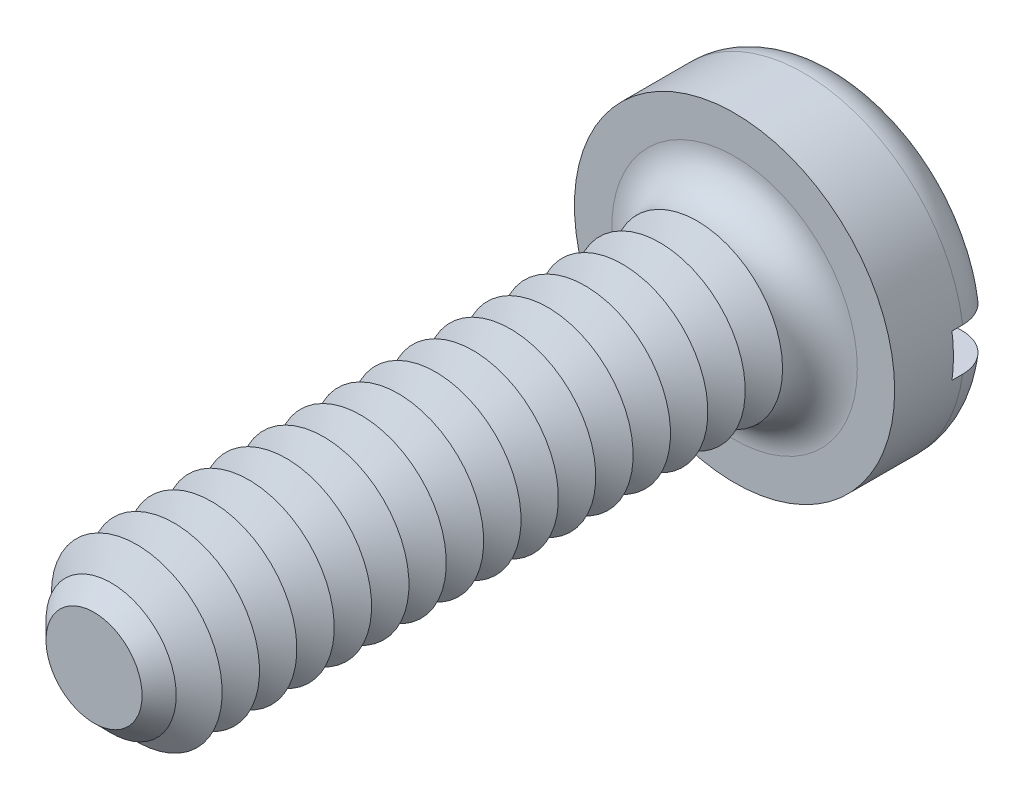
ISO-10303-21;
HEADER;
FILE_DESCRIPTION(('STEP AP214'),'2;1');
FILE_NAME('part.step','',(''),(''),'','','');
FILE_SCHEMA(('AUTOMOTIVE_DESIGN { 1 0 10303 214 1 1 1 1 }'));
ENDSEC;
DATA;
#1=APPLICATION_CONTEXT('core data for automotive mechanical design processes');
#2=APPLICATION_PROTOCOL_DEFINITION('international standard','automotive_design',2000,#1);
#3=PRODUCT_CONTEXT('',#1,'mechanical');
#4=PRODUCT('Part','Part','',(#3));
#5=PRODUCT_RELATED_PRODUCT_CATEGORY('part','',(#4));
#6=PRODUCT_DEFINITION_FORMATION('','',#4);
#7=PRODUCT_DEFINITION_CONTEXT('part definition',#1,'design');
#8=PRODUCT_DEFINITION('design','',#6,#7);
#9=PRODUCT_DEFINITION_SHAPE('','',#8);
#10=(LENGTH_UNIT() NAMED_UNIT(*) SI_UNIT(.MILLI.,.METRE.));
#11=(NAMED_UNIT(*) PLANE_ANGLE_UNIT() SI_UNIT($,.RADIAN.));
#12=(NAMED_UNIT(*) SI_UNIT($,.STERADIAN.) SOLID_ANGLE_UNIT());
#13=UNCERTAINTY_MEASURE_WITH_UNIT(LENGTH_MEASURE(1.E-05),#10,'distance_accuracy_value','');
#14=(GEOMETRIC_REPRESENTATION_CONTEXT(3) GLOBAL_UNCERTAINTY_ASSIGNED_CONTEXT((#13)) GLOBAL_UNIT_ASSIGNED_CONTEXT((#10,
#11,#12)) REPRESENTATION_CONTEXT('',''));
#15=CARTESIAN_POINT('',(0.,0.,0.));
#16=DIRECTION('',(0.,0.,1.));
#17=DIRECTION('',(1.,0.,0.));
#18=AXIS2_PLACEMENT_3D('',#15,#16,#17);
#19=CARTESIAN_POINT('',(0.,0.,-1.));
#20=DIRECTION('',(0.,0.,1.));
#21=DIRECTION('',(1.,0.,0.));
#22=AXIS2_PLACEMENT_3D('',#19,#20,#21);
#23=PLANE('',#22);
#24=CARTESIAN_POINT('',(0.,0.,-1.));
#25=DIRECTION('',(0.,0.,1.));
#26=DIRECTION('',(1.,0.,0.));
#27=AXIS2_PLACEMENT_3D('',#24,#25,#26);
#28=CIRCLE('',#27,1.15);
#29=CARTESIAN_POINT('',(-1.13247516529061,0.2,-1.));
#30=VERTEX_POINT('',#29);
#31=CARTESIAN_POINT('',(1.13247516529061,0.2,-1.));
#32=VERTEX_POINT('',#31);
#33=EDGE_CURVE('E105',#30,#32,#28,.F.);
#34=ORIENTED_EDGE('',*,*,#33,.T.);
#35=DIRECTION('',(1.,0.,0.));
#36=VECTOR('',#35,1.);
#37=CARTESIAN_POINT('',(-1.5,0.2,-1.));
#38=LINE('',#37,#36);
#39=EDGE_CURVE('E101',#30,#32,#38,.T.);
#40=ORIENTED_EDGE('',*,*,#39,.F.);
#41=EDGE_LOOP('',(#34,#40));
#42=FACE_BOUND('',#41,.T.);
#43=ADVANCED_FACE('F32',(#42),#23,.F.);
#44=CARTESIAN_POINT('',(0.,0.,-0.65));
#45=DIRECTION('',(0.,0.,1.));
#46=DIRECTION('',(1.,0.,0.));
#47=AXIS2_PLACEMENT_3D('',#44,#45,#46);
#48=TOROIDAL_SURFACE('',#47,1.15,0.35);
#49=CARTESIAN_POINT('',(-1.38697162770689,0.2,-0.89359719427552));
#50=CARTESIAN_POINT('',(-1.37305556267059,0.2,-0.907805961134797));
#51=CARTESIAN_POINT('',(-1.35791811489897,0.2,-0.9208403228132));
#52=CARTESIAN_POINT('',(-1.32565069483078,0.2,-0.944183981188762));
#53=CARTESIAN_POINT('',(-1.3085180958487,0.2,-0.954489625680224));
#54=CARTESIAN_POINT('',(-1.27278567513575,0.2,-0.972077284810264));
#55=CARTESIAN_POINT('',(-1.25418732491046,0.2,-0.979362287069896));
#56=CARTESIAN_POINT('',(-1.21604452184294,0.2,-0.990735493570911));
#57=CARTESIAN_POINT('',(-1.19650030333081,0.2,-0.994824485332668));
#58=CARTESIAN_POINT('',(-1.15682398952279,0.2,-0.99973845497));
#59=CARTESIAN_POINT('',(-1.1366881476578,0.2,-1.00053316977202));
#60=CARTESIAN_POINT('',(-1.09656272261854,0.2,-0.998770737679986));
#61=CARTESIAN_POINT('',(-1.07657315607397,0.2,-0.996213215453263));
#62=CARTESIAN_POINT('',(-1.03707277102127,0.2,-0.987780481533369));
#63=CARTESIAN_POINT('',(-1.01756977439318,0.2,-0.981868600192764));
#64=CARTESIAN_POINT('',(-0.979825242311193,0.2,-0.966867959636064));
#65=CARTESIAN_POINT('',(-0.961583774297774,0.2,-0.957779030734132));
#66=CARTESIAN_POINT('',(-0.926815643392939,0.2,-0.936628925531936));
#67=CARTESIAN_POINT('',(-0.910295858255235,0.2,-0.924556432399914));
#68=CARTESIAN_POINT('',(-0.879544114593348,0.2,-0.897781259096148));
#69=CARTESIAN_POINT('',(-0.8653120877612,0.2,-0.883078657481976));
#70=CARTESIAN_POINT('',(-0.83972745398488,0.2,-0.851619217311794));
#71=CARTESIAN_POINT('',(-0.8283448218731,0.2,-0.834886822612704));
#72=CARTESIAN_POINT('',(-0.80863848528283,0.2,-0.799707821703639));
#73=CARTESIAN_POINT('',(-0.80031425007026,0.2,-0.781261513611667));
#74=CARTESIAN_POINT('',(-0.787199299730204,0.2,-0.743695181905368));
#75=CARTESIAN_POINT('',(-0.782321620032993,0.2,-0.724605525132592));
#76=CARTESIAN_POINT('',(-0.775930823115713,0.2,-0.685871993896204));
#77=CARTESIAN_POINT('',(-0.774417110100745,0.2,-0.666228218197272));
#78=CARTESIAN_POINT('',(-0.774805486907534,0.2,-0.627456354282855));
#79=CARTESIAN_POINT('',(-0.776625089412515,0.2,-0.608327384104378));
#80=CARTESIAN_POINT('',(-0.783452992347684,0.2,-0.570648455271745));
#81=CARTESIAN_POINT('',(-0.788461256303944,0.2,-0.552098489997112));
#82=CARTESIAN_POINT('',(-0.801489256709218,0.2,-0.516098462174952));
#83=CARTESIAN_POINT('',(-0.809507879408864,0.2,-0.49864799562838));
#84=CARTESIAN_POINT('',(-0.828295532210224,0.2,-0.465297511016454));
#85=CARTESIAN_POINT('',(-0.839064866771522,0.2,-0.449397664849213));
#86=CARTESIAN_POINT('',(-0.863311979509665,0.2,-0.419196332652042));
#87=CARTESIAN_POINT('',(-0.876847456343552,0.2,-0.404941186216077));
#88=CARTESIAN_POINT('',(-0.906064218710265,0.2,-0.378832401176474));
#89=CARTESIAN_POINT('',(-0.921745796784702,0.2,-0.366979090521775));
#90=CARTESIAN_POINT('',(-0.955261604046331,0.2,-0.345690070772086));
#91=CARTESIAN_POINT('',(-0.973141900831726,0.2,-0.336326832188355));
#92=CARTESIAN_POINT('',(-1.01020647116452,0.2,-0.320690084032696));
#93=CARTESIAN_POINT('',(-1.02939085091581,0.2,-0.314416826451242));
#94=CARTESIAN_POINT('',(-1.06878849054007,0.2,-0.305073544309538));
#95=CARTESIAN_POINT('',(-1.0890118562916,0.2,-0.302046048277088));
#96=CARTESIAN_POINT('',(-1.12968032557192,0.2,-0.299436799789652));
#97=CARTESIAN_POINT('',(-1.15012542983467,0.2,-0.299855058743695));
#98=CARTESIAN_POINT('',(-1.1906059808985,0.2,-0.304138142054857));
#99=CARTESIAN_POINT('',(-1.21064224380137,0.2,-0.307995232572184));
#100=CARTESIAN_POINT('',(-1.24976957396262,0.2,-0.319055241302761));
#101=CARTESIAN_POINT('',(-1.26886068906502,0.2,-0.326257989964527));
#102=CARTESIAN_POINT('',(-1.30533597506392,0.2,-0.343725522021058));
#103=CARTESIAN_POINT('',(-1.32273620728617,0.2,-0.353956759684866));
#104=CARTESIAN_POINT('',(-1.35554323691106,0.2,-0.377229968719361));
#105=CARTESIAN_POINT('',(-1.37095016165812,0.2,-0.390271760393));
#106=CARTESIAN_POINT('',(-1.39913145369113,0.2,-0.418621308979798));
#107=CARTESIAN_POINT('',(-1.41193602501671,0.2,-0.43389904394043));
#108=CARTESIAN_POINT('',(-1.43476712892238,0.2,-0.46640589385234));
#109=CARTESIAN_POINT('',(-1.44479381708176,0.2,-0.483634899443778));
#110=CARTESIAN_POINT('',(-1.4616814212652,0.2,-0.519367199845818));
#111=CARTESIAN_POINT('',(-1.46857323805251,0.2,-0.537855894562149));
#112=CARTESIAN_POINT('',(-1.4791331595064,0.2,-0.575731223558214));
#113=CARTESIAN_POINT('',(-1.48280152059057,0.2,-0.595117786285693));
#114=CARTESIAN_POINT('',(-1.4867930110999,0.2,-0.634109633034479));
#115=CARTESIAN_POINT('',(-1.48713684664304,0.2,-0.653712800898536));
#116=CARTESIAN_POINT('',(-1.48452244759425,0.2,-0.692702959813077));
#117=CARTESIAN_POINT('',(-1.48156342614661,0.2,-0.712089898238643));
#118=CARTESIAN_POINT('',(-1.47243636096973,0.2,-0.75006822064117));
#119=CARTESIAN_POINT('',(-1.46627182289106,0.2,-0.768660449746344));
#120=CARTESIAN_POINT('',(-1.45092056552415,0.2,-0.804533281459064));
#121=CARTESIAN_POINT('',(-1.44173755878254,0.2,-0.821815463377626));
#122=CARTESIAN_POINT('',(-1.42477940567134,0.2,-0.848152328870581));
#123=CARTESIAN_POINT('',(-1.41786672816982,0.2,-0.857773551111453));
#124=CARTESIAN_POINT('',(-1.40310412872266,0.2,-0.876267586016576));
#125=CARTESIAN_POINT('',(-1.39525421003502,0.2,-0.885140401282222));
#126=CARTESIAN_POINT('',(-1.38697162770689,0.2,-0.89359719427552));
#127=B_SPLINE_CURVE_WITH_KNOTS('',3,(#49,#50,#51,#52,#53,#54,#55,#56,#57,#58,#59,#60,#61,#62,
#63,#64,#65,#66,#67,#68,#69,#70,#71,#72,#73,#74,#75,#76,#77,#78,#79,#80,#81,#82,#83,#84,#85,#86,
#87,#88,#89,#90,#91,#92,#93,#94,#95,#96,#97,#98,#99,#100,#101,#102,#103,#104,#105,#106,#107,
#108,#109,#110,#111,#112,#113,#114,#115,#116,#117,#118,#119,#120,#121,#122,#123,#124,#125,#126),
.UNSPECIFIED.,.T.,.F.,(4,2,2,2,2,2,2,2,2,2,2,2,2,2,2,2,2,2,2,2,2,2,2,2,2,2,2,2,2,2,2,2,2,2,2,2,
2,2,4),(0.,0.0596211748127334,0.119321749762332,0.178963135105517,0.238589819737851,
0.298763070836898,0.358943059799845,0.419793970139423,0.48064813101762,0.541736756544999,
0.602823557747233,0.663236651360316,0.72363925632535,0.782457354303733,0.841265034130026,
0.898637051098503,0.956008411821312,1.01335856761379,1.07071507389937,1.12941939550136,
1.18813172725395,1.24840147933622,1.30867614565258,1.36973127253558,1.43078660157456,
1.49170496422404,1.55262023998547,1.61288453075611,1.67314496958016,1.73266007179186,
1.792171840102,1.85108355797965,1.90999058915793,1.96853049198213,2.02708434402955,
2.08557429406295,2.14399257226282,2.17947810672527,2.21496351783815),.UNSPECIFIED.);
#128=CARTESIAN_POINT('',(-1.48660687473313,0.2,-0.649999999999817));
#129=VERTEX_POINT('',#128);
#130=EDGE_CURVE('E296',#129,#30,#127,.T.);
#131=ORIENTED_EDGE('',*,*,#130,.F.);
#132=CARTESIAN_POINT('',(0.,0.,-0.65));
#133=DIRECTION('',(0.,0.,1.));
#134=DIRECTION('',(1.,0.,0.));
#135=AXIS2_PLACEMENT_3D('',#132,#133,#134);
#136=CIRCLE('',#135,1.5);
#137=CARTESIAN_POINT('',(1.48660687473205,0.2,-0.649999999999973));
#138=VERTEX_POINT('',#137);
#139=EDGE_CURVE('E110',#138,#129,#136,.T.);
#140=ORIENTED_EDGE('',*,*,#139,.F.);
#141=CARTESIAN_POINT('',(0.780520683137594,0.2,-0.713112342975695));
#142=CARTESIAN_POINT('',(0.784146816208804,0.2,-0.73226748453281));
#143=CARTESIAN_POINT('',(0.789425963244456,0.2,-0.751125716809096));
#144=CARTESIAN_POINT('',(0.803106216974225,0.2,-0.78769198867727));
#145=CARTESIAN_POINT('',(0.811511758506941,0.2,-0.805398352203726));
#146=CARTESIAN_POINT('',(0.831144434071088,0.2,-0.839131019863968));
#147=CARTESIAN_POINT('',(0.842366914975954,0.2,-0.855160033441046));
#148=CARTESIAN_POINT('',(0.867288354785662,0.2,-0.88515062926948));
#149=CARTESIAN_POINT('',(0.880986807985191,0.2,-0.899112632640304));
#150=CARTESIAN_POINT('',(0.910770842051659,0.2,-0.924888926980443));
#151=CARTESIAN_POINT('',(0.926899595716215,0.2,-0.936653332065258));
#152=CARTESIAN_POINT('',(0.960871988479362,0.2,-0.957372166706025));
#153=CARTESIAN_POINT('',(0.978715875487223,0.2,-0.966326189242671));
#154=CARTESIAN_POINT('',(1.01600338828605,0.2,-0.981340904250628));
#155=CARTESIAN_POINT('',(1.03547204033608,0.2,-0.987339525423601));
#156=CARTESIAN_POINT('',(1.07513874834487,0.2,-0.995998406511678));
#157=CARTESIAN_POINT('',(1.09533683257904,0.2,-0.998658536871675));
#158=CARTESIAN_POINT('',(1.1359751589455,0.2,-1.0005575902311));
#159=CARTESIAN_POINT('',(1.1564160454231,0.2,-0.99978283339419));
#160=CARTESIAN_POINT('',(1.19687229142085,0.2,-0.994784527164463));
#161=CARTESIAN_POINT('',(1.21688766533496,0.2,-0.990561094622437));
#162=CARTESIAN_POINT('',(1.25575385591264,0.2,-0.978813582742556));
#163=CARTESIAN_POINT('',(1.27461259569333,0.2,-0.971315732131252));
#164=CARTESIAN_POINT('',(1.31078063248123,0.2,-0.953221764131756));
#165=CARTESIAN_POINT('',(1.32809002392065,0.2,-0.942625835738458));
#166=CARTESIAN_POINT('',(1.36044102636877,0.2,-0.918776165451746));
#167=CARTESIAN_POINT('',(1.37550786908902,0.2,-0.905556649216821));
#168=CARTESIAN_POINT('',(1.40317627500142,0.2,-0.876749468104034));
#169=CARTESIAN_POINT('',(1.41577799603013,0.2,-0.861161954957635));
#170=CARTESIAN_POINT('',(1.43800830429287,0.2,-0.828254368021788));
#171=CARTESIAN_POINT('',(1.44766923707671,0.2,-0.810956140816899));
#172=CARTESIAN_POINT('',(1.46392269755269,0.2,-0.774973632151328));
#173=CARTESIAN_POINT('',(1.4705153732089,0.2,-0.756289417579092));
#174=CARTESIAN_POINT('',(1.48039453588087,0.2,-0.718226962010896));
#175=CARTESIAN_POINT('',(1.48370713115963,0.2,-0.69885549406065));
#176=CARTESIAN_POINT('',(1.48701993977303,0.2,-0.659831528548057));
#177=CARTESIAN_POINT('',(1.4870202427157,0.2,-0.640179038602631));
#178=CARTESIAN_POINT('',(1.48371470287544,0.2,-0.6012267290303));
#179=CARTESIAN_POINT('',(1.48042091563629,0.2,-0.581925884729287));
#180=CARTESIAN_POINT('',(1.47064268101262,0.2,-0.544150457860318));
#181=CARTESIAN_POINT('',(1.46415824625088,0.2,-0.525675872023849));
#182=CARTESIAN_POINT('',(1.4481813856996,0.2,-0.490055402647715));
#183=CARTESIAN_POINT('',(1.43868601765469,0.2,-0.472910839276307));
#184=CARTESIAN_POINT('',(1.41696658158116,0.2,-0.440447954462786));
#185=CARTESIAN_POINT('',(1.40474246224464,0.2,-0.425129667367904));
#186=CARTESIAN_POINT('',(1.37784446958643,0.2,-0.39666049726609));
#187=CARTESIAN_POINT('',(1.36315749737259,0.2,-0.383521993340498));
#188=CARTESIAN_POINT('',(1.33180407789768,0.2,-0.359869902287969));
#189=CARTESIAN_POINT('',(1.31513754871,0.2,-0.349356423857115));
#190=CARTESIAN_POINT('',(1.28013085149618,0.2,-0.331143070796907));
#191=CARTESIAN_POINT('',(1.26177629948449,0.2,-0.323470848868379));
#192=CARTESIAN_POINT('',(1.224049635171,0.2,-0.311275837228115));
#193=CARTESIAN_POINT('',(1.20467746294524,0.2,-0.306753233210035));
#194=CARTESIAN_POINT('',(1.1652160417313,0.2,-0.300927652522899));
#195=CARTESIAN_POINT('',(1.14512096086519,0.2,-0.299664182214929));
#196=CARTESIAN_POINT('',(1.10499953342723,0.2,-0.300488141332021));
#197=CARTESIAN_POINT('',(1.08497319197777,0.2,-0.302575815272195));
#198=CARTESIAN_POINT('',(1.04531606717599,0.2,-0.310075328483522));
#199=CARTESIAN_POINT('',(1.0256923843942,0.2,-0.315524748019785));
#200=CARTESIAN_POINT('',(0.987629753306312,0.2,-0.329624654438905));
#201=CARTESIAN_POINT('',(0.96919087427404,0.2,-0.338275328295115));
#202=CARTESIAN_POINT('',(0.933939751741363,0.2,-0.358590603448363));
#203=CARTESIAN_POINT('',(0.917135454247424,0.2,-0.370269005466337));
#204=CARTESIAN_POINT('',(0.88574931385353,0.2,-0.396306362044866));
#205=CARTESIAN_POINT('',(0.87116734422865,0.2,-0.410665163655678));
#206=CARTESIAN_POINT('',(0.844813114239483,0.2,-0.441518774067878));
#207=CARTESIAN_POINT('',(0.833014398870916,0.2,-0.457990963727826));
#208=CARTESIAN_POINT('',(0.812431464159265,0.2,-0.492729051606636));
#209=CARTESIAN_POINT('',(0.803647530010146,0.2,-0.510995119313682));
#210=CARTESIAN_POINT('',(0.789590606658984,0.2,-0.548308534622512));
#211=CARTESIAN_POINT('',(0.784235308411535,0.2,-0.5673249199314));
#212=CARTESIAN_POINT('',(0.7768953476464,0.2,-0.605979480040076));
#213=CARTESIAN_POINT('',(0.774905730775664,0.2,-0.625616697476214));
#214=CARTESIAN_POINT('',(0.774470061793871,0.2,-0.656633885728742));
#215=CARTESIAN_POINT('',(0.7748847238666,0.2,-0.668009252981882));
#216=CARTESIAN_POINT('',(0.776852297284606,0.2,-0.690660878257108));
#217=CARTESIAN_POINT('',(0.77840517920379,0.2,-0.701937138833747));
#218=CARTESIAN_POINT('',(0.780520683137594,0.2,-0.713112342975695));
#219=B_SPLINE_CURVE_WITH_KNOTS('',3,(#141,#142,#143,#144,#145,#146,#147,#148,#149,#150,#151,
#152,#153,#154,#155,#156,#157,#158,#159,#160,#161,#162,#163,#164,#165,#166,#167,#168,#169,#170,
#171,#172,#173,#174,#175,#176,#177,#178,#179,#180,#181,#182,#183,#184,#185,#186,#187,#188,#189,
#190,#191,#192,#193,#194,#195,#196,#197,#198,#199,#200,#201,#202,#203,#204,#205,#206,#207,#208,
#209,#210,#211,#212,#213,#214,#215,#216,#217,#218),.UNSPECIFIED.,.T.,.F.,(4,2,2,2,2,2,2,2,2,2,2,
2,2,2,2,2,2,2,2,2,2,2,2,2,2,2,2,2,2,2,2,2,2,2,2,2,2,2,4),(0.,0.0584431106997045,
0.11696944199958,0.175399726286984,0.233818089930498,0.293433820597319,0.353058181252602,
0.413886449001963,0.474717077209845,0.53579018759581,0.596861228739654,0.65745180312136,
0.718038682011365,0.777881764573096,0.837721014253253,0.896876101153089,0.95602833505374,
1.01470585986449,1.07338179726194,1.13184377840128,1.19030552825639,1.24882458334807,
1.30734473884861,1.36618662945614,1.42503095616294,1.48443380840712,1.54384016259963,
1.60396331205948,1.66409084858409,1.72490303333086,1.78571877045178,1.84681674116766,
1.90791122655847,1.96839922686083,2.02889294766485,2.08787382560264,2.14676780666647,
2.18086468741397,2.21496068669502),.UNSPECIFIED.);
#220=EDGE_CURVE('E298',#32,#138,#219,.T.);
#221=ORIENTED_EDGE('',*,*,#220,.F.);
#222=ORIENTED_EDGE('',*,*,#33,.F.);
#223=EDGE_LOOP('',(#131,#140,#221,#222));
#224=FACE_BOUND('',#223,.T.);
#225=ADVANCED_FACE('F280',(#224),#48,.T.);
#226=CARTESIAN_POINT('',(0.,0.,-1.));
#227=DIRECTION('',(0.,0.,1.));
#228=DIRECTION('',(1.,0.,0.));
#229=AXIS2_PLACEMENT_3D('',#226,#227,#228);
#230=CYLINDRICAL_SURFACE('',#229,1.5);
#231=DIRECTION('',(0.,0.,1.));
#232=VECTOR('',#231,1.);
#233=CARTESIAN_POINT('',(1.48660687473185,0.2,-1.));
#234=LINE('',#233,#232);
#235=CARTESIAN_POINT('',(1.48660687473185,0.2,-0.55));
#236=VERTEX_POINT('',#235);
#237=EDGE_CURVE('E306',#138,#236,#234,.T.);
#238=ORIENTED_EDGE('',*,*,#237,.F.);
#239=ORIENTED_EDGE('',*,*,#139,.T.);
#240=DIRECTION('',(0.,0.,1.));
#241=VECTOR('',#240,1.);
#242=CARTESIAN_POINT('',(-1.48660687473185,0.2,-1.));
#243=LINE('',#242,#241);
#244=CARTESIAN_POINT('',(-1.48660687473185,0.2,-0.55));
#245=VERTEX_POINT('',#244);
#246=EDGE_CURVE('E55',#245,#129,#243,.F.);
#247=ORIENTED_EDGE('',*,*,#246,.F.);
#248=CARTESIAN_POINT('',(0.,0.,-0.55));
#249=DIRECTION('',(0.,0.,-1.));
#250=DIRECTION('',(-1.,0.,0.));
#251=AXIS2_PLACEMENT_3D('',#248,#249,#250);
#252=CIRCLE('',#251,1.5);
#253=CARTESIAN_POINT('',(-1.48660687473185,-0.2,-0.55));
#254=VERTEX_POINT('',#253);
#255=EDGE_CURVE('E36',#245,#254,#252,.F.);
#256=ORIENTED_EDGE('',*,*,#255,.T.);
#257=DIRECTION('',(0.,0.,1.));
#258=VECTOR('',#257,1.);
#259=CARTESIAN_POINT('',(-1.48660687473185,-0.2,-1.));
#260=LINE('',#259,#258);
#261=CARTESIAN_POINT('',(-1.48660687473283,-0.2,-0.650000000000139));
#262=VERTEX_POINT('',#261);
#263=EDGE_CURVE('E304',#262,#254,#260,.T.);
#264=ORIENTED_EDGE('',*,*,#263,.F.);
#265=CARTESIAN_POINT('',(1.48660687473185,-0.2,-0.65));
#266=VERTEX_POINT('',#265);
#267=EDGE_CURVE('E112',#262,#266,#136,.T.);
#268=ORIENTED_EDGE('',*,*,#267,.T.);
#269=DIRECTION('',(0.,0.,1.));
#270=VECTOR('',#269,1.);
#271=CARTESIAN_POINT('',(1.48660687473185,-0.2,-1.));
#272=LINE('',#271,#270);
#273=CARTESIAN_POINT('',(1.48660687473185,-0.2,-0.55));
#274=VERTEX_POINT('',#273);
#275=EDGE_CURVE('E47',#274,#266,#272,.F.);
#276=ORIENTED_EDGE('',*,*,#275,.F.);
#277=EDGE_CURVE('E11',#274,#236,#252,.F.);
#278=ORIENTED_EDGE('',*,*,#277,.T.);
#279=EDGE_LOOP('',(#238,#239,#247,#256,#264,#268,#276,#278));
#280=FACE_BOUND('',#279,.T.);
#281=CARTESIAN_POINT('',(0.,0.,0.));
#282=DIRECTION('',(0.,0.,1.));
#283=DIRECTION('',(1.,0.,0.));
#284=AXIS2_PLACEMENT_3D('',#281,#282,#283);
#285=CIRCLE('',#284,1.5);
#286=CARTESIAN_POINT('',(1.5,0.,0.));
#287=VERTEX_POINT('',#286);
#288=EDGE_CURVE('E308',#287,#287,#285,.T.);
#289=ORIENTED_EDGE('',*,*,#288,.F.);
#290=EDGE_LOOP('',(#289));
#291=FACE_BOUND('',#290,.T.);
#292=ADVANCED_FACE('F276',(#280,#291),#230,.T.);
#293=CARTESIAN_POINT('',(1.13247516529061,-0.2,-1.));
#294=VERTEX_POINT('',#293);
#295=CARTESIAN_POINT('',(-1.13247516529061,-0.2,-1.));
#296=VERTEX_POINT('',#295);
#297=EDGE_CURVE('E100',#294,#296,#28,.F.);
#298=ORIENTED_EDGE('',*,*,#297,.T.);
#299=DIRECTION('',(-1.,0.,0.));
#300=VECTOR('',#299,1.);
#301=CARTESIAN_POINT('',(-1.5,-0.2,-1.));
#302=LINE('',#301,#300);
#303=EDGE_CURVE('E88',#294,#296,#302,.T.);
#304=ORIENTED_EDGE('',*,*,#303,.F.);
#305=EDGE_LOOP('',(#298,#304));
#306=FACE_BOUND('',#305,.T.);
#307=ADVANCED_FACE('F99',(#306),#23,.F.);
#308=CARTESIAN_POINT('',(0.,0.,0.));
#309=DIRECTION('',(0.,0.,1.));
#310=DIRECTION('',(1.,0.,0.));
#311=AXIS2_PLACEMENT_3D('',#308,#309,#310);
#312=PLANE('',#311);
#313=CARTESIAN_POINT('',(0.,0.,0.));
#314=DIRECTION('',(0.,0.,1.));
#315=DIRECTION('',(1.,0.,0.));
#316=AXIS2_PLACEMENT_3D('',#313,#314,#315);
#317=CIRCLE('',#316,1.15);
#318=CARTESIAN_POINT('',(1.15,0.,0.));
#319=VERTEX_POINT('',#318);
#320=EDGE_CURVE('E104',#319,#319,#317,.F.);
#321=ORIENTED_EDGE('',*,*,#320,.T.);
#322=EDGE_LOOP('',(#321));
#323=FACE_BOUND('',#322,.T.);
#324=ORIENTED_EDGE('',*,*,#288,.T.);
#325=EDGE_LOOP('',(#324));
#326=FACE_BOUND('',#325,.T.);
#327=ADVANCED_FACE('F275',(#323,#326),#312,.T.);
#328=CARTESIAN_POINT('',(-1.38697162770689,-0.2,-0.89359719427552));
#329=CARTESIAN_POINT('',(-1.40068341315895,-0.2,-0.87959447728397));
#330=CARTESIAN_POINT('',(-1.41322919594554,-0.2,-0.864431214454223));
#331=CARTESIAN_POINT('',(-1.43561095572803,-0.2,-0.83220389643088));
#332=CARTESIAN_POINT('',(-1.44544396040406,-0.2,-0.815137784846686));
#333=CARTESIAN_POINT('',(-1.46209732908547,-0.2,-0.779595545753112));
#334=CARTESIAN_POINT('',(-1.46891825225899,-0.2,-0.761119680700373));
#335=CARTESIAN_POINT('',(-1.479344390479,-0.2,-0.723286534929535));
#336=CARTESIAN_POINT('',(-1.48295036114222,-0.2,-0.703929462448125));
#337=CARTESIAN_POINT('',(-1.48683413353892,-0.2,-0.6649653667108));
#338=CARTESIAN_POINT('',(-1.48712565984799,-0.2,-0.645359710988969));
#339=CARTESIAN_POINT('',(-1.48440736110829,-0.2,-0.606378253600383));
#340=CARTESIAN_POINT('',(-1.48139747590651,-0.2,-0.587002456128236));
#341=CARTESIAN_POINT('',(-1.47217267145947,-0.2,-0.549061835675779));
#342=CARTESIAN_POINT('',(-1.46596274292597,-0.2,-0.530495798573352));
#343=CARTESIAN_POINT('',(-1.45052327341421,-0.2,-0.494665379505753));
#344=CARTESIAN_POINT('',(-1.44129371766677,-0.2,-0.477401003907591));
#345=CARTESIAN_POINT('',(-1.42005139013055,-0.2,-0.444603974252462));
#346=CARTESIAN_POINT('',(-1.40803014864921,-0.2,-0.429076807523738));
#347=CARTESIAN_POINT('',(-1.38156905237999,-0.2,-0.400242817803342));
#348=CARTESIAN_POINT('',(-1.36712913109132,-0.2,-0.386936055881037));
#349=CARTESIAN_POINT('',(-1.33612890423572,-0.2,-0.362811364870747));
#350=CARTESIAN_POINT('',(-1.31955365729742,-0.2,-0.352012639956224));
#351=CARTESIAN_POINT('',(-1.28484098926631,-0.2,-0.333316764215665));
#352=CARTESIAN_POINT('',(-1.26670348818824,-0.2,-0.325419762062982));
#353=CARTESIAN_POINT('',(-1.22917040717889,-0.2,-0.31265726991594));
#354=CARTESIAN_POINT('',(-1.20976324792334,-0.2,-0.3078258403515));
#355=CARTESIAN_POINT('',(-1.17041685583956,-0.2,-0.30144641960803));
#356=CARTESIAN_POINT('',(-1.15047758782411,-0.2,-0.299898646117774));
#357=CARTESIAN_POINT('',(-1.11037109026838,-0.2,-0.300112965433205));
#358=CARTESIAN_POINT('',(-1.09020407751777,-0.2,-0.301916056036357));
#359=CARTESIAN_POINT('',(-1.05044996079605,-0.2,-0.308849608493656));
#360=CARTESIAN_POINT('',(-1.03086289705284,-0.2,-0.313980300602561));
#361=CARTESIAN_POINT('',(-0.992636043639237,-0.2,-0.327485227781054));
#362=CARTESIAN_POINT('',(-0.974006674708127,-0.2,-0.335888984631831));
#363=CARTESIAN_POINT('',(-0.938423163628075,-0.2,-0.355707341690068));
#364=CARTESIAN_POINT('',(-0.921469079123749,-0.2,-0.367122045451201));
#365=CARTESIAN_POINT('',(-0.889752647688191,-0.2,-0.392642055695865));
#366=CARTESIAN_POINT('',(-0.874987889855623,-0.2,-0.406744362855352));
#367=CARTESIAN_POINT('',(-0.848085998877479,-0.2,-0.437266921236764));
#368=CARTESIAN_POINT('',(-0.835948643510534,-0.2,-0.453686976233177));
#369=CARTESIAN_POINT('',(-0.814894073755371,-0.2,-0.488078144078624));
#370=CARTESIAN_POINT('',(-0.805923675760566,-0.2,-0.506016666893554));
#371=CARTESIAN_POINT('',(-0.791223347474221,-0.2,-0.543175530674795));
#372=CARTESIAN_POINT('',(-0.78549275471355,-0.2,-0.562395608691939));
#373=CARTESIAN_POINT('',(-0.777599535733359,-0.2,-0.600984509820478));
#374=CARTESIAN_POINT('',(-0.775340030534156,-0.2,-0.62033354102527));
#375=CARTESIAN_POINT('',(-0.774164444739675,-0.2,-0.659131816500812));
#376=CARTESIAN_POINT('',(-0.775247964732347,-0.2,-0.678581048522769));
#377=CARTESIAN_POINT('',(-0.78067015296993,-0.2,-0.716679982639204));
#378=CARTESIAN_POINT('',(-0.784953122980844,-0.2,-0.735337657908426));
#379=CARTESIAN_POINT('',(-0.796558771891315,-0.2,-0.771681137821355));
#380=CARTESIAN_POINT('',(-0.803881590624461,-0.2,-0.789366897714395));
#381=CARTESIAN_POINT('',(-0.821417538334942,-0.2,-0.823475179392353));
#382=CARTESIAN_POINT('',(-0.831660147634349,-0.2,-0.839882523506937));
#383=CARTESIAN_POINT('',(-0.854684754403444,-0.2,-0.870805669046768));
#384=CARTESIAN_POINT('',(-0.867467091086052,-0.2,-0.885321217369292));
#385=CARTESIAN_POINT('',(-0.895584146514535,-0.2,-0.912470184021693));
#386=CARTESIAN_POINT('',(-0.910979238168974,-0.2,-0.925041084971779));
#387=CARTESIAN_POINT('',(-0.943622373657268,-0.2,-0.947488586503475));
#388=CARTESIAN_POINT('',(-0.960870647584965,-0.2,-0.957364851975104));
#389=CARTESIAN_POINT('',(-0.997151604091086,-0.2,-0.974359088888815));
#390=CARTESIAN_POINT('',(-1.01621564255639,-0.2,-0.98141019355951));
#391=CARTESIAN_POINT('',(-1.05525219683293,-0.2,-0.992235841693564));
#392=CARTESIAN_POINT('',(-1.07522472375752,-0.2,-0.996010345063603));
#393=CARTESIAN_POINT('',(-1.11565152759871,-0.2,-1.00018247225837));
#394=CARTESIAN_POINT('',(-1.1361080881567,-0.2,-1.00055804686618));
#395=CARTESIAN_POINT('',(-1.17679659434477,-0.2,-0.997846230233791));
#396=CARTESIAN_POINT('',(-1.19702848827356,-0.2,-0.994758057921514));
#397=CARTESIAN_POINT('',(-1.23655375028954,-0.2,-0.985216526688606));
#398=CARTESIAN_POINT('',(-1.25585198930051,-0.2,-0.978783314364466));
#399=CARTESIAN_POINT('',(-1.29305658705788,-0.2,-0.962732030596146));
#400=CARTESIAN_POINT('',(-1.31096467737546,-0.2,-0.953118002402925));
#401=CARTESIAN_POINT('',(-1.33859353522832,-0.2,-0.935076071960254));
#402=CARTESIAN_POINT('',(-1.34889525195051,-0.2,-0.927521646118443));
#403=CARTESIAN_POINT('',(-1.36861998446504,-0.2,-0.911341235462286));
#404=CARTESIAN_POINT('',(-1.37804300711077,-0.2,-0.90271525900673));
#405=CARTESIAN_POINT('',(-1.38697162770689,-0.2,-0.89359719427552));
#406=B_SPLINE_CURVE_WITH_KNOTS('',3,(#328,#329,#330,#331,#332,#333,#334,#335,#336,#337,#338,
#339,#340,#341,#342,#343,#344,#345,#346,#347,#348,#349,#350,#351,#352,#353,#354,#355,#356,#357,
#358,#359,#360,#361,#362,#363,#364,#365,#366,#367,#368,#369,#370,#371,#372,#373,#374,#375,#376,
#377,#378,#379,#380,#381,#382,#383,#384,#385,#386,#387,#388,#389,#390,#391,#392,#393,#394,#395,
#396,#397,#398,#399,#400,#401,#402,#403,#404,#405),.UNSPECIFIED.,.T.,.F.,(4,2,2,2,2,2,2,2,2,2,2,
2,2,2,2,2,2,2,2,2,2,2,2,2,2,2,2,2,2,2,2,2,2,2,2,2,2,2,4),(0.,0.0587484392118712,
0.117560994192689,0.17636262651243,0.235150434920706,0.293694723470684,0.352240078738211,
0.410694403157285,0.46914901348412,0.527783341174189,0.586419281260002,0.645490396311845,
0.704564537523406,0.76428403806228,0.824007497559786,0.884466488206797,0.944929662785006,
1.00595131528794,1.06697506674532,1.12793111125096,1.18888199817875,1.2487542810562,
1.30861431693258,1.36677117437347,1.4249210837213,1.48208160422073,1.53924475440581,
1.59700685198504,1.65477666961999,1.71413044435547,1.77349159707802,1.83418476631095,
1.89487867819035,1.95596603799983,2.01706717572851,2.07780450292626,2.13846491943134,
2.17672008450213,2.21497495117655),.UNSPECIFIED.);
#407=EDGE_CURVE('E94',#296,#262,#406,.T.);
#408=ORIENTED_EDGE('',*,*,#407,.F.);
#409=ORIENTED_EDGE('',*,*,#297,.F.);
#410=CARTESIAN_POINT('',(0.780520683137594,-0.2,-0.713112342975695));
#411=CARTESIAN_POINT('',(0.776967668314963,-0.2,-0.694332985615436));
#412=CARTESIAN_POINT('',(0.774997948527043,-0.2,-0.675240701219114));
#413=CARTESIAN_POINT('',(0.774305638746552,-0.2,-0.636983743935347));
#414=CARTESIAN_POINT('',(0.775586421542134,-0.2,-0.617819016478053));
#415=CARTESIAN_POINT('',(0.781350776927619,-0.2,-0.579992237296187));
#416=CARTESIAN_POINT('',(0.78583187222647,-0.2,-0.56132980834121));
#417=CARTESIAN_POINT('',(0.797836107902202,-0.2,-0.525016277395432));
#418=CARTESIAN_POINT('',(0.805358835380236,-0.2,-0.507365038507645));
#419=CARTESIAN_POINT('',(0.823276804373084,-0.2,-0.47338978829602));
#420=CARTESIAN_POINT('',(0.833696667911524,-0.2,-0.457078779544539));
#421=CARTESIAN_POINT('',(0.857057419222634,-0.2,-0.426375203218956));
#422=CARTESIAN_POINT('',(0.869998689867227,-0.2,-0.411982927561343));
#423=CARTESIAN_POINT('',(0.898418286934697,-0.2,-0.38510575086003));
#424=CARTESIAN_POINT('',(0.913956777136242,-0.2,-0.372684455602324));
#425=CARTESIAN_POINT('',(0.946860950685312,-0.2,-0.350558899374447));
#426=CARTESIAN_POINT('',(0.964226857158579,-0.2,-0.340854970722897));
#427=CARTESIAN_POINT('',(1.00070854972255,-0.2,-0.324232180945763));
#428=CARTESIAN_POINT('',(1.01985442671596,-0.2,-0.317379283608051));
#429=CARTESIAN_POINT('',(1.0590214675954,-0.2,-0.306962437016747));
#430=CARTESIAN_POINT('',(1.07904267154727,-0.2,-0.303398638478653));
#431=CARTESIAN_POINT('',(1.11952320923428,-0.2,-0.299657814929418));
#432=CARTESIAN_POINT('',(1.13998446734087,-0.2,-0.299501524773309));
#433=CARTESIAN_POINT('',(1.1806395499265,-0.2,-0.302650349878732));
#434=CARTESIAN_POINT('',(1.20083338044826,-0.2,-0.305955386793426));
#435=CARTESIAN_POINT('',(1.24023260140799,-0.2,-0.315918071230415));
#436=CARTESIAN_POINT('',(1.25944372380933,-0.2,-0.322553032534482));
#437=CARTESIAN_POINT('',(1.29645854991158,-0.2,-0.338992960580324));
#438=CARTESIAN_POINT('',(1.31426233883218,-0.2,-0.348797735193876));
#439=CARTESIAN_POINT('',(1.34772734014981,-0.2,-0.371172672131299));
#440=CARTESIAN_POINT('',(1.36341179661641,-0.2,-0.383708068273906));
#441=CARTESIAN_POINT('',(1.39242189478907,-0.2,-0.41126267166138));
#442=CARTESIAN_POINT('',(1.40574768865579,-0.2,-0.426281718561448));
#443=CARTESIAN_POINT('',(1.42949833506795,-0.2,-0.458186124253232));
#444=CARTESIAN_POINT('',(1.43995542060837,-0.2,-0.475047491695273));
#445=CARTESIAN_POINT('',(1.45786189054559,-0.2,-0.510298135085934));
#446=CARTESIAN_POINT('',(1.46531142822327,-0.2,-0.528687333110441));
#447=CARTESIAN_POINT('',(1.47692889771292,-0.2,-0.566301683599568));
#448=CARTESIAN_POINT('',(1.48112438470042,-0.2,-0.585518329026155));
#449=CARTESIAN_POINT('',(1.48621428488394,-0.2,-0.624383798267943));
#450=CARTESIAN_POINT('',(1.48710879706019,-0.2,-0.644032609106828));
#451=CARTESIAN_POINT('',(1.48557356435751,-0.2,-0.683115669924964));
#452=CARTESIAN_POINT('',(1.48315796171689,-0.2,-0.702550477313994));
#453=CARTESIAN_POINT('',(1.47509909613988,-0.2,-0.740738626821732));
#454=CARTESIAN_POINT('',(1.46945585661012,-0.2,-0.759491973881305));
#455=CARTESIAN_POINT('',(1.45510530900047,-0.2,-0.79579446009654));
#456=CARTESIAN_POINT('',(1.44639690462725,-0.2,-0.813343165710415));
#457=CARTESIAN_POINT('',(1.42617120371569,-0.2,-0.846738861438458));
#458=CARTESIAN_POINT('',(1.41465386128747,-0.2,-0.862585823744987));
#459=CARTESIAN_POINT('',(1.3890808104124,-0.2,-0.892214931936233));
#460=CARTESIAN_POINT('',(1.37501291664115,-0.2,-0.90598655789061));
#461=CARTESIAN_POINT('',(1.34478283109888,-0.2,-0.930997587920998));
#462=CARTESIAN_POINT('',(1.32862056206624,-0.2,-0.942236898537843));
#463=CARTESIAN_POINT('',(1.29450693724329,-0.2,-0.96197581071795));
#464=CARTESIAN_POINT('',(1.27654077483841,-0.2,-0.970449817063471));
#465=CARTESIAN_POINT('',(1.23945233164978,-0.2,-0.984300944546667));
#466=CARTESIAN_POINT('',(1.2203299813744,-0.2,-0.989677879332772));
#467=CARTESIAN_POINT('',(1.18123021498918,-0.2,-0.997250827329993));
#468=CARTESIAN_POINT('',(1.16124534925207,-0.2,-0.999408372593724));
#469=CARTESIAN_POINT('',(1.12119456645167,-0.2,-1.00037966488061));
#470=CARTESIAN_POINT('',(1.10112864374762,-0.2,-0.999193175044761));
#471=CARTESIAN_POINT('',(1.06123417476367,-0.2,-0.993489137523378));
#472=CARTESIAN_POINT('',(1.0414112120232,-0.2,-0.988932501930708));
#473=CARTESIAN_POINT('',(1.00280276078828,-0.2,-0.976576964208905));
#474=CARTESIAN_POINT('',(0.984017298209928,-0.2,-0.968777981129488));
#475=CARTESIAN_POINT('',(0.947906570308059,-0.2,-0.95009587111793));
#476=CARTESIAN_POINT('',(0.930590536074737,-0.2,-0.939194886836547));
#477=CARTESIAN_POINT('',(0.89804559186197,-0.2,-0.914617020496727));
#478=CARTESIAN_POINT('',(0.882817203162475,-0.2,-0.900939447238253));
#479=CARTESIAN_POINT('',(0.855020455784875,-0.2,-0.871287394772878));
#480=CARTESIAN_POINT('',(0.84243415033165,-0.2,-0.855329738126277));
#481=CARTESIAN_POINT('',(0.820210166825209,-0.2,-0.821497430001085));
#482=CARTESIAN_POINT('',(0.810568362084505,-0.2,-0.803625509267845));
#483=CARTESIAN_POINT('',(0.797588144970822,-0.2,-0.773519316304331));
#484=CARTESIAN_POINT('',(0.793244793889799,-0.2,-0.761708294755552));
#485=CARTESIAN_POINT('',(0.785879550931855,-0.2,-0.737680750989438));
#486=CARTESIAN_POINT('',(0.782857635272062,-0.2,-0.725464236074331));
#487=CARTESIAN_POINT('',(0.780520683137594,-0.2,-0.713112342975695));
#488=B_SPLINE_CURVE_WITH_KNOTS('',3,(#410,#411,#412,#413,#414,#415,#416,#417,#418,#419,#420,
#421,#422,#423,#424,#425,#426,#427,#428,#429,#430,#431,#432,#433,#434,#435,#436,#437,#438,#439,
#440,#441,#442,#443,#444,#445,#446,#447,#448,#449,#450,#451,#452,#453,#454,#455,#456,#457,#458,
#459,#460,#461,#462,#463,#464,#465,#466,#467,#468,#469,#470,#471,#472,#473,#474,#475,#476,#477,
#478,#479,#480,#481,#482,#483,#484,#485,#486,#487),.UNSPECIFIED.,.T.,.F.,(4,2,2,2,2,2,2,2,2,2,2,
2,2,2,2,2,2,2,2,2,2,2,2,2,2,2,2,2,2,2,2,2,2,2,2,2,2,2,4),(0.,0.057291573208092,
0.114642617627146,0.171949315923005,0.229248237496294,0.287049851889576,0.344860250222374,
0.404266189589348,0.463679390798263,0.524399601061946,0.585122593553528,0.646214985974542,
0.707305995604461,0.767986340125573,0.828663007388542,0.888608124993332,0.948549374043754,
1.00778662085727,1.06702084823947,1.12574783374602,1.18447305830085,1.24294816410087,
1.30142284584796,1.35991846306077,1.41841503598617,1.47719881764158,1.5359847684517,
1.59530034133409,1.65461948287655,1.71464189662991,1.77466856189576,1.83540257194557,
1.89613809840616,1.9572305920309,2.01833831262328,2.0790164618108,2.13960917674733,
2.17729268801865,2.21497552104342),.UNSPECIFIED.);
#489=EDGE_CURVE('E84',#266,#294,#488,.T.);
#490=ORIENTED_EDGE('',*,*,#489,.F.);
#491=ORIENTED_EDGE('',*,*,#267,.F.);
#492=EDGE_LOOP('',(#408,#409,#490,#491));
#493=FACE_BOUND('',#492,.T.);
#494=ADVANCED_FACE('F103',(#493),#48,.T.);
#495=CARTESIAN_POINT('',(0.,0.,0.35));
#496=DIRECTION('',(0.,0.,1.));
#497=DIRECTION('',(1.,0.,0.));
#498=AXIS2_PLACEMENT_3D('',#495,#496,#497);
#499=TOROIDAL_SURFACE('',#498,1.15,0.35);
#500=ORIENTED_EDGE('',*,*,#320,.F.);
#501=EDGE_LOOP('',(#500));
#502=FACE_BOUND('',#501,.T.);
#503=CARTESIAN_POINT('',(0.,0.,0.35));
#504=DIRECTION('',(0.,0.,-1.));
#505=DIRECTION('',(-1.,0.,0.));
#506=AXIS2_PLACEMENT_3D('',#503,#504,#505);
#507=CIRCLE('',#506,0.8);
#508=CARTESIAN_POINT('',(-0.8,0.,0.35));
#509=VERTEX_POINT('',#508);
#510=EDGE_CURVE('E310',#509,#509,#507,.T.);
#511=ORIENTED_EDGE('',*,*,#510,.T.);
#512=EDGE_LOOP('',(#511));
#513=FACE_BOUND('',#512,.T.);
#514=ADVANCED_FACE('F268',(#502,#513),#499,.F.);
#515=CARTESIAN_POINT('',(0.,0.,0.524999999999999));
#516=DIRECTION('',(0.,0.,-1.));
#517=DIRECTION('',(-1.,0.,0.));
#518=AXIS2_PLACEMENT_3D('',#515,#516,#517);
#519=CONICAL_SURFACE('',#518,0.496891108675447,1.0471975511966);
#520=ORIENTED_EDGE('',*,*,#510,.F.);
#521=EDGE_LOOP('',(#520));
#522=FACE_BOUND('',#521,.T.);
#523=CARTESIAN_POINT('',(0.,0.,0.524999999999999));
#524=DIRECTION('',(0.,0.,-1.));
#525=DIRECTION('',(-1.,0.,0.));
#526=AXIS2_PLACEMENT_3D('',#523,#524,#525);
#527=CIRCLE('',#526,0.496891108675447);
#528=CARTESIAN_POINT('',(-0.496891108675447,0.,0.524999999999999));
#529=VERTEX_POINT('',#528);
#530=EDGE_CURVE('E314',#529,#529,#527,.T.);
#531=ORIENTED_EDGE('',*,*,#530,.T.);
#532=EDGE_LOOP('',(#531));
#533=FACE_BOUND('',#532,.T.);
#534=ADVANCED_FACE('F264',(#522,#533),#519,.T.);
#535=CARTESIAN_POINT('',(0.,0.,0.7));
#536=DIRECTION('',(0.,0.,1.));
#537=DIRECTION('',(1.,0.,0.));
#538=AXIS2_PLACEMENT_3D('',#535,#536,#537);
#539=CONICAL_SURFACE('',#538,0.8,1.0471975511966);
#540=ORIENTED_EDGE('',*,*,#530,.F.);
#541=EDGE_LOOP('',(#540));
#542=FACE_BOUND('',#541,.T.);
#543=CARTESIAN_POINT('',(0.,0.,0.7));
#544=DIRECTION('',(0.,0.,-1.));
#545=DIRECTION('',(-1.,0.,0.));
#546=AXIS2_PLACEMENT_3D('',#543,#544,#545);
#547=CIRCLE('',#546,0.8);
#548=CARTESIAN_POINT('',(-0.8,0.,0.7));
#549=VERTEX_POINT('',#548);
#550=EDGE_CURVE('E319',#549,#549,#547,.T.);
#551=ORIENTED_EDGE('',*,*,#550,.T.);
#552=EDGE_LOOP('',(#551));
#553=FACE_BOUND('',#552,.T.);
#554=ADVANCED_FACE('F260',(#542,#553),#539,.T.);
#555=CARTESIAN_POINT('',(0.,0.,0.874999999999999));
#556=DIRECTION('',(0.,0.,-1.));
#557=DIRECTION('',(-1.,0.,0.));
#558=AXIS2_PLACEMENT_3D('',#555,#556,#557);
#559=CONICAL_SURFACE('',#558,0.496891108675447,1.0471975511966);
#560=ORIENTED_EDGE('',*,*,#550,.F.);
#561=EDGE_LOOP('',(#560));
#562=FACE_BOUND('',#561,.T.);
#563=CARTESIAN_POINT('',(0.,0.,0.874999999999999));
#564=DIRECTION('',(0.,0.,-1.));
#565=DIRECTION('',(-1.,0.,0.));
#566=AXIS2_PLACEMENT_3D('',#563,#564,#565);
#567=CIRCLE('',#566,0.496891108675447);
#568=CARTESIAN_POINT('',(-0.496891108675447,0.,0.874999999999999));
#569=VERTEX_POINT('',#568);
#570=EDGE_CURVE('E322',#569,#569,#567,.T.);
#571=ORIENTED_EDGE('',*,*,#570,.T.);
#572=EDGE_LOOP('',(#571));
#573=FACE_BOUND('',#572,.T.);
#574=ADVANCED_FACE('F256',(#562,#573),#559,.T.);
#575=CARTESIAN_POINT('',(0.,0.,1.05));
#576=DIRECTION('',(0.,0.,1.));
#577=DIRECTION('',(1.,0.,0.));
#578=AXIS2_PLACEMENT_3D('',#575,#576,#577);
#579=CONICAL_SURFACE('',#578,0.8,1.0471975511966);
#580=ORIENTED_EDGE('',*,*,#570,.F.);
#581=EDGE_LOOP('',(#580));
#582=FACE_BOUND('',#581,.T.);
#583=CARTESIAN_POINT('',(0.,0.,1.05));
#584=DIRECTION('',(0.,0.,-1.));
#585=DIRECTION('',(-1.,0.,0.));
#586=AXIS2_PLACEMENT_3D('',#583,#584,#585);
#587=CIRCLE('',#586,0.8);
#588=CARTESIAN_POINT('',(-0.8,0.,1.05));
#589=VERTEX_POINT('',#588);
#590=EDGE_CURVE('E325',#589,#589,#587,.T.);
#591=ORIENTED_EDGE('',*,*,#590,.T.);
#592=EDGE_LOOP('',(#591));
#593=FACE_BOUND('',#592,.T.);
#594=ADVANCED_FACE('F252',(#582,#593),#579,.T.);
#595=CARTESIAN_POINT('',(0.,0.,1.225));
#596=DIRECTION('',(0.,0.,-1.));
#597=DIRECTION('',(-1.,0.,0.));
#598=AXIS2_PLACEMENT_3D('',#595,#596,#597);
#599=CONICAL_SURFACE('',#598,0.496891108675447,1.0471975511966);
#600=ORIENTED_EDGE('',*,*,#590,.F.);
#601=EDGE_LOOP('',(#600));
#602=FACE_BOUND('',#601,.T.);
#603=CARTESIAN_POINT('',(0.,0.,1.225));
#604=DIRECTION('',(0.,0.,-1.));
#605=DIRECTION('',(-1.,0.,0.));
#606=AXIS2_PLACEMENT_3D('',#603,#604,#605);
#607=CIRCLE('',#606,0.496891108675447);
#608=CARTESIAN_POINT('',(-0.496891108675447,0.,1.225));
#609=VERTEX_POINT('',#608);
#610=EDGE_CURVE('E328',#609,#609,#607,.T.);
#611=ORIENTED_EDGE('',*,*,#610,.T.);
#612=EDGE_LOOP('',(#611));
#613=FACE_BOUND('',#612,.T.);
#614=ADVANCED_FACE('F248',(#602,#613),#599,.T.);
#615=CARTESIAN_POINT('',(0.,0.,1.4));
#616=DIRECTION('',(0.,0.,1.));
#617=DIRECTION('',(1.,0.,0.));
#618=AXIS2_PLACEMENT_3D('',#615,#616,#617);
#619=CONICAL_SURFACE('',#618,0.8,1.0471975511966);
#620=ORIENTED_EDGE('',*,*,#610,.F.);
#621=EDGE_LOOP('',(#620));
#622=FACE_BOUND('',#621,.T.);
#623=CARTESIAN_POINT('',(0.,0.,1.4));
#624=DIRECTION('',(0.,0.,-1.));
#625=DIRECTION('',(-1.,0.,0.));
#626=AXIS2_PLACEMENT_3D('',#623,#624,#625);
#627=CIRCLE('',#626,0.8);
#628=CARTESIAN_POINT('',(-0.8,0.,1.4));
#629=VERTEX_POINT('',#628);
#630=EDGE_CURVE('E331',#629,#629,#627,.T.);
#631=ORIENTED_EDGE('',*,*,#630,.T.);
#632=EDGE_LOOP('',(#631));
#633=FACE_BOUND('',#632,.T.);
#634=ADVANCED_FACE('F244',(#622,#633),#619,.T.);
#635=CARTESIAN_POINT('',(0.,0.,1.575));
#636=DIRECTION('',(0.,0.,-1.));
#637=DIRECTION('',(-1.,0.,0.));
#638=AXIS2_PLACEMENT_3D('',#635,#636,#637);
#639=CONICAL_SURFACE('',#638,0.496891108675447,1.0471975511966);
#640=ORIENTED_EDGE('',*,*,#630,.F.);
#641=EDGE_LOOP('',(#640));
#642=FACE_BOUND('',#641,.T.);
#643=CARTESIAN_POINT('',(0.,0.,1.575));
#644=DIRECTION('',(0.,0.,-1.));
#645=DIRECTION('',(-1.,0.,0.));
#646=AXIS2_PLACEMENT_3D('',#643,#644,#645);
#647=CIRCLE('',#646,0.496891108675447);
#648=CARTESIAN_POINT('',(-0.496891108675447,0.,1.575));
#649=VERTEX_POINT('',#648);
#650=EDGE_CURVE('E334',#649,#649,#647,.T.);
#651=ORIENTED_EDGE('',*,*,#650,.T.);
#652=EDGE_LOOP('',(#651));
#653=FACE_BOUND('',#652,.T.);
#654=ADVANCED_FACE('F240',(#642,#653),#639,.T.);
#655=CARTESIAN_POINT('',(0.,0.,1.75));
#656=DIRECTION('',(0.,0.,1.));
#657=DIRECTION('',(1.,0.,0.));
#658=AXIS2_PLACEMENT_3D('',#655,#656,#657);
#659=CONICAL_SURFACE('',#658,0.8,1.0471975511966);
#660=ORIENTED_EDGE('',*,*,#650,.F.);
#661=EDGE_LOOP('',(#660));
#662=FACE_BOUND('',#661,.T.);
#663=CARTESIAN_POINT('',(0.,0.,1.75));
#664=DIRECTION('',(0.,0.,-1.));
#665=DIRECTION('',(-1.,0.,0.));
#666=AXIS2_PLACEMENT_3D('',#663,#664,#665);
#667=CIRCLE('',#666,0.8);
#668=CARTESIAN_POINT('',(-0.8,0.,1.75));
#669=VERTEX_POINT('',#668);
#670=EDGE_CURVE('E337',#669,#669,#667,.T.);
#671=ORIENTED_EDGE('',*,*,#670,.T.);
#672=EDGE_LOOP('',(#671));
#673=FACE_BOUND('',#672,.T.);
#674=ADVANCED_FACE('F236',(#662,#673),#659,.T.);
#675=CARTESIAN_POINT('',(0.,0.,1.925));
#676=DIRECTION('',(0.,0.,-1.));
#677=DIRECTION('',(-1.,0.,0.));
#678=AXIS2_PLACEMENT_3D('',#675,#676,#677);
#679=CONICAL_SURFACE('',#678,0.496891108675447,1.0471975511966);
#680=ORIENTED_EDGE('',*,*,#670,.F.);
#681=EDGE_LOOP('',(#680));
#682=FACE_BOUND('',#681,.T.);
#683=CARTESIAN_POINT('',(0.,0.,1.925));
#684=DIRECTION('',(0.,0.,-1.));
#685=DIRECTION('',(-1.,0.,0.));
#686=AXIS2_PLACEMENT_3D('',#683,#684,#685);
#687=CIRCLE('',#686,0.496891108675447);
#688=CARTESIAN_POINT('',(-0.496891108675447,0.,1.925));
#689=VERTEX_POINT('',#688);
#690=EDGE_CURVE('E340',#689,#689,#687,.T.);
#691=ORIENTED_EDGE('',*,*,#690,.T.);
#692=EDGE_LOOP('',(#691));
#693=FACE_BOUND('',#692,.T.);
#694=ADVANCED_FACE('F232',(#682,#693),#679,.T.);
#695=CARTESIAN_POINT('',(0.,0.,2.1));
#696=DIRECTION('',(0.,0.,1.));
#697=DIRECTION('',(1.,0.,0.));
#698=AXIS2_PLACEMENT_3D('',#695,#696,#697);
#699=CONICAL_SURFACE('',#698,0.8,1.0471975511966);
#700=ORIENTED_EDGE('',*,*,#690,.F.);
#701=EDGE_LOOP('',(#700));
#702=FACE_BOUND('',#701,.T.);
#703=CARTESIAN_POINT('',(0.,0.,2.1));
#704=DIRECTION('',(0.,0.,-1.));
#705=DIRECTION('',(-1.,0.,0.));
#706=AXIS2_PLACEMENT_3D('',#703,#704,#705);
#707=CIRCLE('',#706,0.8);
#708=CARTESIAN_POINT('',(-0.8,0.,2.1));
#709=VERTEX_POINT('',#708);
#710=EDGE_CURVE('E343',#709,#709,#707,.T.);
#711=ORIENTED_EDGE('',*,*,#710,.T.);
#712=EDGE_LOOP('',(#711));
#713=FACE_BOUND('',#712,.T.);
#714=ADVANCED_FACE('F228',(#702,#713),#699,.T.);
#715=CARTESIAN_POINT('',(0.,0.,2.275));
#716=DIRECTION('',(0.,0.,-1.));
#717=DIRECTION('',(-1.,0.,0.));
#718=AXIS2_PLACEMENT_3D('',#715,#716,#717);
#719=CONICAL_SURFACE('',#718,0.496891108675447,1.0471975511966);
#720=ORIENTED_EDGE('',*,*,#710,.F.);
#721=EDGE_LOOP('',(#720));
#722=FACE_BOUND('',#721,.T.);
#723=CARTESIAN_POINT('',(0.,0.,2.275));
#724=DIRECTION('',(0.,0.,-1.));
#725=DIRECTION('',(-1.,0.,0.));
#726=AXIS2_PLACEMENT_3D('',#723,#724,#725);
#727=CIRCLE('',#726,0.496891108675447);
#728=CARTESIAN_POINT('',(-0.496891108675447,0.,2.275));
#729=VERTEX_POINT('',#728);
#730=EDGE_CURVE('E346',#729,#729,#727,.T.);
#731=ORIENTED_EDGE('',*,*,#730,.T.);
#732=EDGE_LOOP('',(#731));
#733=FACE_BOUND('',#732,.T.);
#734=ADVANCED_FACE('F224',(#722,#733),#719,.T.);
#735=CARTESIAN_POINT('',(0.,0.,2.45));
#736=DIRECTION('',(0.,0.,1.));
#737=DIRECTION('',(1.,0.,0.));
#738=AXIS2_PLACEMENT_3D('',#735,#736,#737);
#739=CONICAL_SURFACE('',#738,0.8,1.0471975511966);
#740=ORIENTED_EDGE('',*,*,#730,.F.);
#741=EDGE_LOOP('',(#740));
#742=FACE_BOUND('',#741,.T.);
#743=CARTESIAN_POINT('',(0.,0.,2.45));
#744=DIRECTION('',(0.,0.,-1.));
#745=DIRECTION('',(-1.,0.,0.));
#746=AXIS2_PLACEMENT_3D('',#743,#744,#745);
#747=CIRCLE('',#746,0.8);
#748=CARTESIAN_POINT('',(-0.8,0.,2.45));
#749=VERTEX_POINT('',#748);
#750=EDGE_CURVE('E349',#749,#749,#747,.T.);
#751=ORIENTED_EDGE('',*,*,#750,.T.);
#752=EDGE_LOOP('',(#751));
#753=FACE_BOUND('',#752,.T.);
#754=ADVANCED_FACE('F220',(#742,#753),#739,.T.);
#755=CARTESIAN_POINT('',(0.,0.,2.625));
#756=DIRECTION('',(0.,0.,-1.));
#757=DIRECTION('',(-1.,0.,0.));
#758=AXIS2_PLACEMENT_3D('',#755,#756,#757);
#759=CONICAL_SURFACE('',#758,0.496891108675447,1.0471975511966);
#760=ORIENTED_EDGE('',*,*,#750,.F.);
#761=EDGE_LOOP('',(#760));
#762=FACE_BOUND('',#761,.T.);
#763=CARTESIAN_POINT('',(0.,0.,2.625));
#764=DIRECTION('',(0.,0.,-1.));
#765=DIRECTION('',(-1.,0.,0.));
#766=AXIS2_PLACEMENT_3D('',#763,#764,#765);
#767=CIRCLE('',#766,0.496891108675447);
#768=CARTESIAN_POINT('',(-0.496891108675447,0.,2.625));
#769=VERTEX_POINT('',#768);
#770=EDGE_CURVE('E352',#769,#769,#767,.T.);
#771=ORIENTED_EDGE('',*,*,#770,.T.);
#772=EDGE_LOOP('',(#771));
#773=FACE_BOUND('',#772,.T.);
#774=ADVANCED_FACE('F216',(#762,#773),#759,.T.);
#775=CARTESIAN_POINT('',(0.,0.,2.8));
#776=DIRECTION('',(0.,0.,1.));
#777=DIRECTION('',(1.,0.,0.));
#778=AXIS2_PLACEMENT_3D('',#775,#776,#777);
#779=CONICAL_SURFACE('',#778,0.8,1.0471975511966);
#780=ORIENTED_EDGE('',*,*,#770,.F.);
#781=EDGE_LOOP('',(#780));
#782=FACE_BOUND('',#781,.T.);
#783=CARTESIAN_POINT('',(0.,0.,2.8));
#784=DIRECTION('',(0.,0.,-1.));
#785=DIRECTION('',(-1.,0.,0.));
#786=AXIS2_PLACEMENT_3D('',#783,#784,#785);
#787=CIRCLE('',#786,0.8);
#788=CARTESIAN_POINT('',(-0.8,0.,2.8));
#789=VERTEX_POINT('',#788);
#790=EDGE_CURVE('E355',#789,#789,#787,.T.);
#791=ORIENTED_EDGE('',*,*,#790,.T.);
#792=EDGE_LOOP('',(#791));
#793=FACE_BOUND('',#792,.T.);
#794=ADVANCED_FACE('F212',(#782,#793),#779,.T.);
#795=CARTESIAN_POINT('',(0.,0.,2.975));
#796=DIRECTION('',(0.,0.,-1.));
#797=DIRECTION('',(-1.,0.,0.));
#798=AXIS2_PLACEMENT_3D('',#795,#796,#797);
#799=CONICAL_SURFACE('',#798,0.496891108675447,1.0471975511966);
#800=ORIENTED_EDGE('',*,*,#790,.F.);
#801=EDGE_LOOP('',(#800));
#802=FACE_BOUND('',#801,.T.);
#803=CARTESIAN_POINT('',(0.,0.,2.975));
#804=DIRECTION('',(0.,0.,-1.));
#805=DIRECTION('',(-1.,0.,0.));
#806=AXIS2_PLACEMENT_3D('',#803,#804,#805);
#807=CIRCLE('',#806,0.496891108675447);
#808=CARTESIAN_POINT('',(-0.496891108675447,0.,2.975));
#809=VERTEX_POINT('',#808);
#810=EDGE_CURVE('E358',#809,#809,#807,.T.);
#811=ORIENTED_EDGE('',*,*,#810,.T.);
#812=EDGE_LOOP('',(#811));
#813=FACE_BOUND('',#812,.T.);
#814=ADVANCED_FACE('F208',(#802,#813),#799,.T.);
#815=CARTESIAN_POINT('',(0.,0.,3.15));
#816=DIRECTION('',(0.,0.,1.));
#817=DIRECTION('',(1.,0.,0.));
#818=AXIS2_PLACEMENT_3D('',#815,#816,#817);
#819=CONICAL_SURFACE('',#818,0.8,1.0471975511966);
#820=ORIENTED_EDGE('',*,*,#810,.F.);
#821=EDGE_LOOP('',(#820));
#822=FACE_BOUND('',#821,.T.);
#823=CARTESIAN_POINT('',(0.,0.,3.15));
#824=DIRECTION('',(0.,0.,-1.));
#825=DIRECTION('',(-1.,0.,0.));
#826=AXIS2_PLACEMENT_3D('',#823,#824,#825);
#827=CIRCLE('',#826,0.8);
#828=CARTESIAN_POINT('',(-0.8,0.,3.15));
#829=VERTEX_POINT('',#828);
#830=EDGE_CURVE('E361',#829,#829,#827,.T.);
#831=ORIENTED_EDGE('',*,*,#830,.T.);
#832=EDGE_LOOP('',(#831));
#833=FACE_BOUND('',#832,.T.);
#834=ADVANCED_FACE('F204',(#822,#833),#819,.T.);
#835=CARTESIAN_POINT('',(0.,0.,3.325));
#836=DIRECTION('',(0.,0.,-1.));
#837=DIRECTION('',(-1.,0.,0.));
#838=AXIS2_PLACEMENT_3D('',#835,#836,#837);
#839=CONICAL_SURFACE('',#838,0.496891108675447,1.0471975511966);
#840=ORIENTED_EDGE('',*,*,#830,.F.);
#841=EDGE_LOOP('',(#840));
#842=FACE_BOUND('',#841,.T.);
#843=CARTESIAN_POINT('',(0.,0.,3.325));
#844=DIRECTION('',(0.,0.,-1.));
#845=DIRECTION('',(-1.,0.,0.));
#846=AXIS2_PLACEMENT_3D('',#843,#844,#845);
#847=CIRCLE('',#846,0.496891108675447);
#848=CARTESIAN_POINT('',(-0.496891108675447,0.,3.325));
#849=VERTEX_POINT('',#848);
#850=EDGE_CURVE('E364',#849,#849,#847,.T.);
#851=ORIENTED_EDGE('',*,*,#850,.T.);
#852=EDGE_LOOP('',(#851));
#853=FACE_BOUND('',#852,.T.);
#854=ADVANCED_FACE('F200',(#842,#853),#839,.T.);
#855=CARTESIAN_POINT('',(0.,0.,3.5));
#856=DIRECTION('',(0.,0.,1.));
#857=DIRECTION('',(1.,0.,0.));
#858=AXIS2_PLACEMENT_3D('',#855,#856,#857);
#859=CONICAL_SURFACE('',#858,0.8,1.0471975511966);
#860=ORIENTED_EDGE('',*,*,#850,.F.);
#861=EDGE_LOOP('',(#860));
#862=FACE_BOUND('',#861,.T.);
#863=CARTESIAN_POINT('',(0.,0.,3.5));
#864=DIRECTION('',(0.,0.,-1.));
#865=DIRECTION('',(-1.,0.,0.));
#866=AXIS2_PLACEMENT_3D('',#863,#864,#865);
#867=CIRCLE('',#866,0.8);
#868=CARTESIAN_POINT('',(-0.8,0.,3.5));
#869=VERTEX_POINT('',#868);
#870=EDGE_CURVE('E367',#869,#869,#867,.T.);
#871=ORIENTED_EDGE('',*,*,#870,.T.);
#872=EDGE_LOOP('',(#871));
#873=FACE_BOUND('',#872,.T.);
#874=ADVANCED_FACE('F196',(#862,#873),#859,.T.);
#875=CARTESIAN_POINT('',(0.,0.,3.675));
#876=DIRECTION('',(0.,0.,-1.));
#877=DIRECTION('',(-1.,0.,0.));
#878=AXIS2_PLACEMENT_3D('',#875,#876,#877);
#879=CONICAL_SURFACE('',#878,0.496891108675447,1.0471975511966);
#880=ORIENTED_EDGE('',*,*,#870,.F.);
#881=EDGE_LOOP('',(#880));
#882=FACE_BOUND('',#881,.T.);
#883=CARTESIAN_POINT('',(0.,0.,3.675));
#884=DIRECTION('',(0.,0.,-1.));
#885=DIRECTION('',(-1.,0.,0.));
#886=AXIS2_PLACEMENT_3D('',#883,#884,#885);
#887=CIRCLE('',#886,0.496891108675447);
#888=CARTESIAN_POINT('',(-0.496891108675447,0.,3.675));
#889=VERTEX_POINT('',#888);
#890=EDGE_CURVE('E370',#889,#889,#887,.T.);
#891=ORIENTED_EDGE('',*,*,#890,.T.);
#892=EDGE_LOOP('',(#891));
#893=FACE_BOUND('',#892,.T.);
#894=ADVANCED_FACE('F192',(#882,#893),#879,.T.);
#895=CARTESIAN_POINT('',(0.,0.,3.85));
#896=DIRECTION('',(0.,0.,1.));
#897=DIRECTION('',(1.,0.,0.));
#898=AXIS2_PLACEMENT_3D('',#895,#896,#897);
#899=CONICAL_SURFACE('',#898,0.8,1.0471975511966);
#900=ORIENTED_EDGE('',*,*,#890,.F.);
#901=EDGE_LOOP('',(#900));
#902=FACE_BOUND('',#901,.T.);
#903=CARTESIAN_POINT('',(0.,0.,3.85));
#904=DIRECTION('',(0.,0.,-1.));
#905=DIRECTION('',(-1.,0.,0.));
#906=AXIS2_PLACEMENT_3D('',#903,#904,#905);
#907=CIRCLE('',#906,0.8);
#908=CARTESIAN_POINT('',(-0.8,0.,3.85));
#909=VERTEX_POINT('',#908);
#910=EDGE_CURVE('E373',#909,#909,#907,.T.);
#911=ORIENTED_EDGE('',*,*,#910,.T.);
#912=EDGE_LOOP('',(#911));
#913=FACE_BOUND('',#912,.T.);
#914=ADVANCED_FACE('F188',(#902,#913),#899,.T.);
#915=CARTESIAN_POINT('',(0.,0.,4.025));
#916=DIRECTION('',(0.,0.,-1.));
#917=DIRECTION('',(-1.,0.,0.));
#918=AXIS2_PLACEMENT_3D('',#915,#916,#917);
#919=CONICAL_SURFACE('',#918,0.496891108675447,1.0471975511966);
#920=ORIENTED_EDGE('',*,*,#910,.F.);
#921=EDGE_LOOP('',(#920));
#922=FACE_BOUND('',#921,.T.);
#923=CARTESIAN_POINT('',(0.,0.,4.025));
#924=DIRECTION('',(0.,0.,-1.));
#925=DIRECTION('',(-1.,0.,0.));
#926=AXIS2_PLACEMENT_3D('',#923,#924,#925);
#927=CIRCLE('',#926,0.496891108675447);
#928=CARTESIAN_POINT('',(-0.496891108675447,0.,4.025));
#929=VERTEX_POINT('',#928);
#930=EDGE_CURVE('E376',#929,#929,#927,.T.);
#931=ORIENTED_EDGE('',*,*,#930,.T.);
#932=EDGE_LOOP('',(#931));
#933=FACE_BOUND('',#932,.T.);
#934=ADVANCED_FACE('F184',(#922,#933),#919,.T.);
#935=CARTESIAN_POINT('',(0.,0.,4.2));
#936=DIRECTION('',(0.,0.,1.));
#937=DIRECTION('',(1.,0.,0.));
#938=AXIS2_PLACEMENT_3D('',#935,#936,#937);
#939=CONICAL_SURFACE('',#938,0.8,1.0471975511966);
#940=ORIENTED_EDGE('',*,*,#930,.F.);
#941=EDGE_LOOP('',(#940));
#942=FACE_BOUND('',#941,.T.);
#943=CARTESIAN_POINT('',(0.,0.,4.2));
#944=DIRECTION('',(0.,0.,-1.));
#945=DIRECTION('',(-1.,0.,0.));
#946=AXIS2_PLACEMENT_3D('',#943,#944,#945);
#947=CIRCLE('',#946,0.8);
#948=CARTESIAN_POINT('',(-0.8,0.,4.2));
#949=VERTEX_POINT('',#948);
#950=EDGE_CURVE('E379',#949,#949,#947,.T.);
#951=ORIENTED_EDGE('',*,*,#950,.T.);
#952=EDGE_LOOP('',(#951));
#953=FACE_BOUND('',#952,.T.);
#954=ADVANCED_FACE('F180',(#942,#953),#939,.T.);
#955=CARTESIAN_POINT('',(0.,0.,4.375));
#956=DIRECTION('',(0.,0.,-1.));
#957=DIRECTION('',(-1.,0.,0.));
#958=AXIS2_PLACEMENT_3D('',#955,#956,#957);
#959=CONICAL_SURFACE('',#958,0.496891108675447,1.0471975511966);
#960=ORIENTED_EDGE('',*,*,#950,.F.);
#961=EDGE_LOOP('',(#960));
#962=FACE_BOUND('',#961,.T.);
#963=CARTESIAN_POINT('',(0.,0.,4.375));
#964=DIRECTION('',(0.,0.,-1.));
#965=DIRECTION('',(-1.,0.,0.));
#966=AXIS2_PLACEMENT_3D('',#963,#964,#965);
#967=CIRCLE('',#966,0.496891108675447);
#968=CARTESIAN_POINT('',(-0.496891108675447,0.,4.375));
#969=VERTEX_POINT('',#968);
#970=EDGE_CURVE('E382',#969,#969,#967,.T.);
#971=ORIENTED_EDGE('',*,*,#970,.T.);
#972=EDGE_LOOP('',(#971));
#973=FACE_BOUND('',#972,.T.);
#974=ADVANCED_FACE('F176',(#962,#973),#959,.T.);
#975=CARTESIAN_POINT('',(0.,0.,4.55));
#976=DIRECTION('',(0.,0.,1.));
#977=DIRECTION('',(1.,0.,0.));
#978=AXIS2_PLACEMENT_3D('',#975,#976,#977);
#979=CONICAL_SURFACE('',#978,0.8,1.0471975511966);
#980=ORIENTED_EDGE('',*,*,#970,.F.);
#981=EDGE_LOOP('',(#980));
#982=FACE_BOUND('',#981,.T.);
#983=CARTESIAN_POINT('',(0.,0.,4.55));
#984=DIRECTION('',(0.,0.,-1.));
#985=DIRECTION('',(-1.,0.,0.));
#986=AXIS2_PLACEMENT_3D('',#983,#984,#985);
#987=CIRCLE('',#986,0.8);
#988=CARTESIAN_POINT('',(-0.8,0.,4.55));
#989=VERTEX_POINT('',#988);
#990=EDGE_CURVE('E385',#989,#989,#987,.T.);
#991=ORIENTED_EDGE('',*,*,#990,.T.);
#992=EDGE_LOOP('',(#991));
#993=FACE_BOUND('',#992,.T.);
#994=ADVANCED_FACE('F172',(#982,#993),#979,.T.);
#995=CARTESIAN_POINT('',(0.,0.,4.725));
#996=DIRECTION('',(0.,0.,-1.));
#997=DIRECTION('',(-1.,0.,0.));
#998=AXIS2_PLACEMENT_3D('',#995,#996,#997);
#999=CONICAL_SURFACE('',#998,0.496891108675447,1.0471975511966);
#1000=ORIENTED_EDGE('',*,*,#990,.F.);
#1001=EDGE_LOOP('',(#1000));
#1002=FACE_BOUND('',#1001,.T.);
#1003=CARTESIAN_POINT('',(0.,0.,4.725));
#1004=DIRECTION('',(0.,0.,-1.));
#1005=DIRECTION('',(-1.,0.,0.));
#1006=AXIS2_PLACEMENT_3D('',#1003,#1004,#1005);
#1007=CIRCLE('',#1006,0.496891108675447);
#1008=CARTESIAN_POINT('',(-0.496891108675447,0.,4.725));
#1009=VERTEX_POINT('',#1008);
#1010=EDGE_CURVE('E388',#1009,#1009,#1007,.T.);
#1011=ORIENTED_EDGE('',*,*,#1010,.T.);
#1012=EDGE_LOOP('',(#1011));
#1013=FACE_BOUND('',#1012,.T.);
#1014=ADVANCED_FACE('F168',(#1002,#1013),#999,.T.);
#1015=CARTESIAN_POINT('',(0.,0.,4.9));
#1016=DIRECTION('',(0.,0.,1.));
#1017=DIRECTION('',(1.,0.,0.));
#1018=AXIS2_PLACEMENT_3D('',#1015,#1016,#1017);
#1019=CONICAL_SURFACE('',#1018,0.8,1.0471975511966);
#1020=ORIENTED_EDGE('',*,*,#1010,.F.);
#1021=EDGE_LOOP('',(#1020));
#1022=FACE_BOUND('',#1021,.T.);
#1023=CARTESIAN_POINT('',(0.,0.,4.9));
#1024=DIRECTION('',(0.,0.,-1.));
#1025=DIRECTION('',(-1.,0.,0.));
#1026=AXIS2_PLACEMENT_3D('',#1023,#1024,#1025);
#1027=CIRCLE('',#1026,0.8);
#1028=CARTESIAN_POINT('',(-0.8,0.,4.9));
#1029=VERTEX_POINT('',#1028);
#1030=EDGE_CURVE('E391',#1029,#1029,#1027,.T.);
#1031=ORIENTED_EDGE('',*,*,#1030,.T.);
#1032=EDGE_LOOP('',(#1031));
#1033=FACE_BOUND('',#1032,.T.);
#1034=ADVANCED_FACE('F164',(#1022,#1033),#1019,.T.);
#1035=CARTESIAN_POINT('',(0.,0.,5.075));
#1036=DIRECTION('',(0.,0.,-1.));
#1037=DIRECTION('',(-1.,0.,0.));
#1038=AXIS2_PLACEMENT_3D('',#1035,#1036,#1037);
#1039=CONICAL_SURFACE('',#1038,0.496891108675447,1.0471975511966);
#1040=ORIENTED_EDGE('',*,*,#1030,.F.);
#1041=EDGE_LOOP('',(#1040));
#1042=FACE_BOUND('',#1041,.T.);
#1043=CARTESIAN_POINT('',(0.,0.,5.075));
#1044=DIRECTION('',(0.,0.,-1.));
#1045=DIRECTION('',(-1.,0.,0.));
#1046=AXIS2_PLACEMENT_3D('',#1043,#1044,#1045);
#1047=CIRCLE('',#1046,0.496891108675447);
#1048=CARTESIAN_POINT('',(-0.496891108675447,0.,5.075));
#1049=VERTEX_POINT('',#1048);
#1050=EDGE_CURVE('E394',#1049,#1049,#1047,.T.);
#1051=ORIENTED_EDGE('',*,*,#1050,.T.);
#1052=EDGE_LOOP('',(#1051));
#1053=FACE_BOUND('',#1052,.T.);
#1054=ADVANCED_FACE('F160',(#1042,#1053),#1039,.T.);
#1055=CARTESIAN_POINT('',(0.,0.,5.25));
#1056=DIRECTION('',(0.,0.,1.));
#1057=DIRECTION('',(1.,0.,0.));
#1058=AXIS2_PLACEMENT_3D('',#1055,#1056,#1057);
#1059=CONICAL_SURFACE('',#1058,0.8,1.0471975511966);
#1060=ORIENTED_EDGE('',*,*,#1050,.F.);
#1061=EDGE_LOOP('',(#1060));
#1062=FACE_BOUND('',#1061,.T.);
#1063=CARTESIAN_POINT('',(0.,0.,5.25));
#1064=DIRECTION('',(0.,0.,-1.));
#1065=DIRECTION('',(-1.,0.,0.));
#1066=AXIS2_PLACEMENT_3D('',#1063,#1064,#1065);
#1067=CIRCLE('',#1066,0.8);
#1068=CARTESIAN_POINT('',(-0.8,0.,5.25));
#1069=VERTEX_POINT('',#1068);
#1070=EDGE_CURVE('E397',#1069,#1069,#1067,.T.);
#1071=ORIENTED_EDGE('',*,*,#1070,.T.);
#1072=EDGE_LOOP('',(#1071));
#1073=FACE_BOUND('',#1072,.T.);
#1074=ADVANCED_FACE('F156',(#1062,#1073),#1059,.T.);
#1075=CARTESIAN_POINT('',(0.,0.,5.425));
#1076=DIRECTION('',(0.,0.,-1.));
#1077=DIRECTION('',(-1.,0.,0.));
#1078=AXIS2_PLACEMENT_3D('',#1075,#1076,#1077);
#1079=CONICAL_SURFACE('',#1078,0.496891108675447,1.0471975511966);
#1080=ORIENTED_EDGE('',*,*,#1070,.F.);
#1081=EDGE_LOOP('',(#1080));
#1082=FACE_BOUND('',#1081,.T.);
#1083=CARTESIAN_POINT('',(0.,0.,5.425));
#1084=DIRECTION('',(0.,0.,-1.));
#1085=DIRECTION('',(-1.,0.,0.));
#1086=AXIS2_PLACEMENT_3D('',#1083,#1084,#1085);
#1087=CIRCLE('',#1086,0.496891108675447);
#1088=CARTESIAN_POINT('',(-0.496891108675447,0.,5.425));
#1089=VERTEX_POINT('',#1088);
#1090=EDGE_CURVE('E119',#1089,#1089,#1087,.T.);
#1091=ORIENTED_EDGE('',*,*,#1090,.T.);
#1092=EDGE_LOOP('',(#1091));
#1093=FACE_BOUND('',#1092,.T.);
#1094=ADVANCED_FACE('F152',(#1082,#1093),#1079,.T.);
#1095=CARTESIAN_POINT('',(0.,0.,5.6));
#1096=DIRECTION('',(0.,0.,1.));
#1097=DIRECTION('',(1.,0.,0.));
#1098=AXIS2_PLACEMENT_3D('',#1095,#1096,#1097);
#1099=CONICAL_SURFACE('',#1098,0.8,1.0471975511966);
#1100=ORIENTED_EDGE('',*,*,#1090,.F.);
#1101=EDGE_LOOP('',(#1100));
#1102=FACE_BOUND('',#1101,.T.);
#1103=CARTESIAN_POINT('',(0.,0.,5.6));
#1104=DIRECTION('',(0.,0.,-1.));
#1105=DIRECTION('',(-1.,0.,0.));
#1106=AXIS2_PLACEMENT_3D('',#1103,#1104,#1105);
#1107=CIRCLE('',#1106,0.8);
#1108=CARTESIAN_POINT('',(-0.8,0.,5.6));
#1109=VERTEX_POINT('',#1108);
#1110=EDGE_CURVE('E120',#1109,#1109,#1107,.T.);
#1111=ORIENTED_EDGE('',*,*,#1110,.T.);
#1112=EDGE_LOOP('',(#1111));
#1113=FACE_BOUND('',#1112,.T.);
#1114=ADVANCED_FACE('F148',(#1102,#1113),#1099,.T.);
#1115=CARTESIAN_POINT('',(0.,0.,5.775));
#1116=DIRECTION('',(0.,0.,-1.));
#1117=DIRECTION('',(-1.,0.,0.));
#1118=AXIS2_PLACEMENT_3D('',#1115,#1116,#1117);
#1119=CONICAL_SURFACE('',#1118,0.496891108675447,1.0471975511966);
#1120=ORIENTED_EDGE('',*,*,#1110,.F.);
#1121=EDGE_LOOP('',(#1120));
#1122=FACE_BOUND('',#1121,.T.);
#1123=CARTESIAN_POINT('',(0.,0.,5.775));
#1124=DIRECTION('',(0.,0.,-1.));
#1125=DIRECTION('',(-1.,0.,0.));
#1126=AXIS2_PLACEMENT_3D('',#1123,#1124,#1125);
#1127=CIRCLE('',#1126,0.496891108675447);
#1128=CARTESIAN_POINT('',(-0.496891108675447,0.,5.775));
#1129=VERTEX_POINT('',#1128);
#1130=EDGE_CURVE('E404',#1129,#1129,#1127,.T.);
#1131=ORIENTED_EDGE('',*,*,#1130,.T.);
#1132=EDGE_LOOP('',(#1131));
#1133=FACE_BOUND('',#1132,.T.);
#1134=ADVANCED_FACE('F144',(#1122,#1133),#1119,.T.);
#1135=CARTESIAN_POINT('',(0.,0.,5.95));
#1136=DIRECTION('',(0.,0.,1.));
#1137=DIRECTION('',(1.,0.,0.));
#1138=AXIS2_PLACEMENT_3D('',#1135,#1136,#1137);
#1139=CONICAL_SURFACE('',#1138,0.8,1.0471975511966);
#1140=CARTESIAN_POINT('',(0.,0.,5.84019237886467));
#1141=DIRECTION('',(0.,0.,1.));
#1142=DIRECTION('',(1.,0.,0.));
#1143=AXIS2_PLACEMENT_3D('',#1140,#1141,#1142);
#1144=CIRCLE('',#1143,0.609807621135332);
#1145=CARTESIAN_POINT('',(0.609807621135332,0.,5.84019237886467));
#1146=VERTEX_POINT('',#1145);
#1147=EDGE_CURVE('E117',#1146,#1146,#1144,.F.);
#1148=ORIENTED_EDGE('',*,*,#1147,.T.);
#1149=EDGE_LOOP('',(#1148));
#1150=FACE_BOUND('',#1149,.T.);
#1151=ORIENTED_EDGE('',*,*,#1130,.F.);
#1152=EDGE_LOOP('',(#1151));
#1153=FACE_BOUND('',#1152,.T.);
#1154=ADVANCED_FACE('F139',(#1150,#1153),#1139,.T.);
#1155=CARTESIAN_POINT('',(0.,0.,6.));
#1156=DIRECTION('',(0.,0.,1.));
#1157=DIRECTION('',(1.,0.,0.));
#1158=AXIS2_PLACEMENT_3D('',#1155,#1156,#1157);
#1159=PLANE('',#1158);
#1160=CARTESIAN_POINT('',(0.,0.,6.));
#1161=DIRECTION('',(0.,0.,1.));
#1162=DIRECTION('',(1.,0.,0.));
#1163=AXIS2_PLACEMENT_3D('',#1160,#1161,#1162);
#1164=CIRCLE('',#1163,0.450000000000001);
#1165=CARTESIAN_POINT('',(0.450000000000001,0.,6.));
#1166=VERTEX_POINT('',#1165);
#1167=EDGE_CURVE('E95',#1166,#1166,#1164,.T.);
#1168=ORIENTED_EDGE('',*,*,#1167,.T.);
#1169=EDGE_LOOP('',(#1168));
#1170=FACE_BOUND('',#1169,.T.);
#1171=ADVANCED_FACE('F143',(#1170),#1159,.T.);
#1172=CARTESIAN_POINT('',(0.,0.,6.));
#1173=DIRECTION('',(0.,0.,-1.));
#1174=DIRECTION('',(-1.,0.,0.));
#1175=AXIS2_PLACEMENT_3D('',#1172,#1173,#1174);
#1176=CONICAL_SURFACE('',#1175,0.450000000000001,0.785398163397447);
#1177=ORIENTED_EDGE('',*,*,#1147,.F.);
#1178=EDGE_LOOP('',(#1177));
#1179=FACE_BOUND('',#1178,.T.);
#1180=ORIENTED_EDGE('',*,*,#1167,.F.);
#1181=EDGE_LOOP('',(#1180));
#1182=FACE_BOUND('',#1181,.T.);
#1183=ADVANCED_FACE('F34',(#1179,#1182),#1176,.T.);
#1184=CARTESIAN_POINT('',(-1.5,0.2,-0.55));
#1185=DIRECTION('',(0.,1.,0.));
#1186=DIRECTION('',(-1.,0.,0.));
#1187=AXIS2_PLACEMENT_3D('',#1184,#1185,#1186);
#1188=PLANE('',#1187);
#1189=ORIENTED_EDGE('',*,*,#246,.T.);
#1190=ORIENTED_EDGE('',*,*,#130,.T.);
#1191=ORIENTED_EDGE('',*,*,#39,.T.);
#1192=ORIENTED_EDGE('',*,*,#220,.T.);
#1193=ORIENTED_EDGE('',*,*,#237,.T.);
#1194=DIRECTION('',(1.,0.,0.));
#1195=VECTOR('',#1194,1.);
#1196=CARTESIAN_POINT('',(-1.5,0.2,-0.55));
#1197=LINE('',#1196,#1195);
#1198=EDGE_CURVE('E410',#245,#236,#1197,.T.);
#1199=ORIENTED_EDGE('',*,*,#1198,.F.);
#1200=EDGE_LOOP('',(#1189,#1190,#1191,#1192,#1193,#1199));
#1201=FACE_BOUND('',#1200,.T.);
#1202=ADVANCED_FACE('F136',(#1201),#1188,.F.);
#1203=CARTESIAN_POINT('',(-1.5,-0.2,-0.55));
#1204=DIRECTION('',(0.,-1.,0.));
#1205=DIRECTION('',(1.,0.,0.));
#1206=AXIS2_PLACEMENT_3D('',#1203,#1204,#1205);
#1207=PLANE('',#1206);
#1208=ORIENTED_EDGE('',*,*,#263,.T.);
#1209=DIRECTION('',(-1.,0.,0.));
#1210=VECTOR('',#1209,1.);
#1211=CARTESIAN_POINT('',(-1.5,-0.2,-0.55));
#1212=LINE('',#1211,#1210);
#1213=EDGE_CURVE('E411',#274,#254,#1212,.T.);
#1214=ORIENTED_EDGE('',*,*,#1213,.F.);
#1215=ORIENTED_EDGE('',*,*,#275,.T.);
#1216=ORIENTED_EDGE('',*,*,#489,.T.);
#1217=ORIENTED_EDGE('',*,*,#303,.T.);
#1218=ORIENTED_EDGE('',*,*,#407,.T.);
#1219=EDGE_LOOP('',(#1208,#1214,#1215,#1216,#1217,#1218));
#1220=FACE_BOUND('',#1219,.T.);
#1221=ADVANCED_FACE('F87',(#1220),#1207,.F.);
#1222=CARTESIAN_POINT('',(0.,0.,-0.55));
#1223=DIRECTION('',(0.,0.,-1.));
#1224=DIRECTION('',(-1.,0.,0.));
#1225=AXIS2_PLACEMENT_3D('',#1222,#1223,#1224);
#1226=PLANE('',#1225);
#1227=ORIENTED_EDGE('',*,*,#1213,.T.);
#1228=ORIENTED_EDGE('',*,*,#255,.F.);
#1229=ORIENTED_EDGE('',*,*,#1198,.T.);
#1230=ORIENTED_EDGE('',*,*,#277,.F.);
#1231=EDGE_LOOP('',(#1227,#1228,#1229,#1230));
#1232=FACE_BOUND('',#1231,.T.);
#1233=ADVANCED_FACE('F135',(#1232),#1226,.T.);
#1234=CLOSED_SHELL('',(#43,#225,#292,#307,#327,#494,#514,#534,#554,#574,#594,#614,#634,#654,
#674,#694,#714,#734,#754,#774,#794,#814,#834,#854,#874,#894,#914,#934,#954,#974,#994,#1014,
#1034,#1054,#1074,#1094,#1114,#1134,#1154,#1171,#1183,#1202,#1221,#1233));
#1235=MANIFOLD_SOLID_BREP('B2',#1234);
#1236=ADVANCED_BREP_SHAPE_REPRESENTATION('',(#18,#1235),#14);
#1237=SHAPE_DEFINITION_REPRESENTATION(#9,#1236);
ENDSEC;
END-ISO-10303-21;
